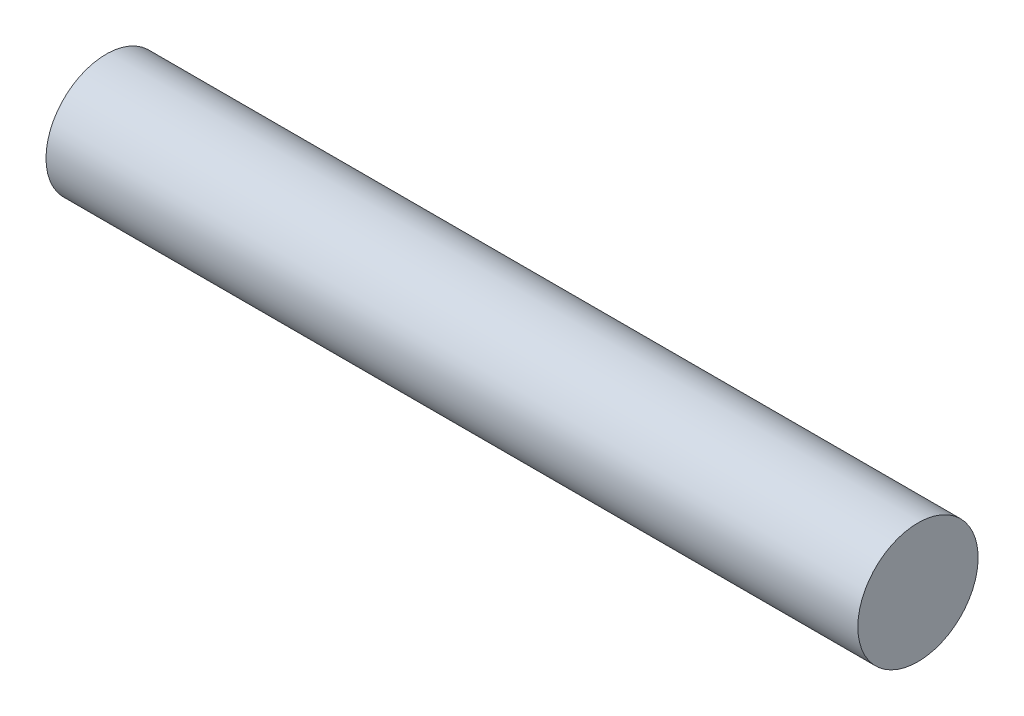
from build123d import *

# Parameters (mm, degrees)
SKETCH1_W = 27
SKETCH1_H = 2.000000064


with BuildPart() as part:
    # Sketch1 → Revolve1 (revolve)
    with BuildSketch(Plane.XY, mode=Mode.PRIVATE) as revolve1_sk:
        with Locations((13.5, 1.000000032)):
            Rectangle(SKETCH1_W, SKETCH1_H)
    revolve(revolve1_sk.sketch.rotate(Axis((27, 0, 0), (-1, 0, 0)), 270), axis=Axis((27, 0, 0), (-1, 0, 0)))


solid = part.part
